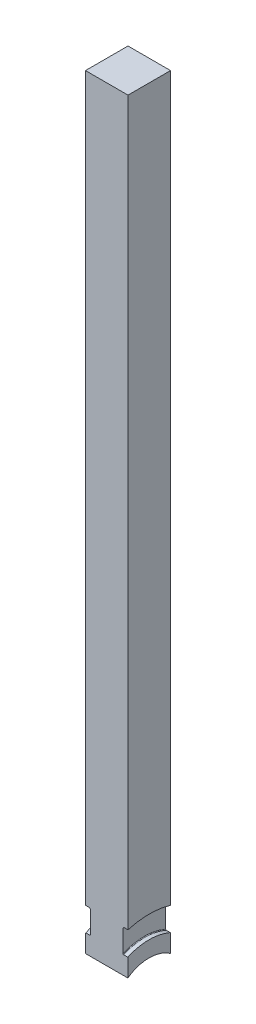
from build123d import *

# Parameters (mm, degrees)
SKETCH1_W               = 25.654
SKETCH1_H               = 479.425
BOSS_EXTRUDE1_DEPTH     = 12.827
CUT_EXTRUDE4_DEPTH      = 480.768063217
CUT_EXTRUDE4_DEPTH_BACK = 480.768063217
SKETCH8_R               = 22.225
SKETCH2_W               = 2.9718
SKETCH2_H               = 13.4874
CUT_EXTRUDE3_DEPTH      = 480.768063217
CUT_EXTRUDE3_DEPTH_BACK = 480.768063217
SKETCH7_W               = 0.127
SKETCH7_H               = 31.75
FILLET1_R               = 0.762
FILLET2_R               = 0.381


with BuildPart() as part:
    # Sketch1 → Boss-Extrude1 (new, symmetric)
    with BuildSketch(Plane(origin=(0, 0, 0), x_dir=(0, 0, -1), z_dir=(1, 0, 0))):
        with Locations((0, 239.7125)):
            Rectangle(SKETCH1_W, SKETCH1_H)
    extrude(amount=BOSS_EXTRUDE1_DEPTH, both=True)

    # Sketch8 → Cut-Extrude4 (cut, two sides: drawn at the far end of the back side and taken through both)
    with BuildSketch(Plane(origin=(0, 0, 0), x_dir=(0, 0, -1), z_dir=(1, 0, 0)).offset(-CUT_EXTRUDE4_DEPTH_BACK)):
        Circle(SKETCH8_R)
    extrude(amount=CUT_EXTRUDE4_DEPTH + CUT_EXTRUDE4_DEPTH_BACK, mode=Mode.SUBTRACT)

    # Sketch2 → Cut-Revolve1 (revolve, cut)
    with BuildSketch(Plane.XY):
        with Locations((11.3411, 38.4937)):
            Rectangle(SKETCH2_W, SKETCH2_H)
        with Locations((-11.3411, 38.4937)):
            Rectangle(SKETCH2_W, SKETCH2_H)
    revolve(axis=Axis((-8.84822894, 0, 0), (1, 0, 0)), mode=Mode.SUBTRACT)

    # Sketch7 → Cut-Extrude3 (cut, two sides: drawn at the far end of the back side and taken through both)
    with BuildSketch(Plane.XY.offset(-CUT_EXTRUDE3_DEPTH_BACK)):
        with Locations((-12.7635, 15.875)):
            Rectangle(SKETCH7_W, SKETCH7_H)
        with Locations((12.7635, 15.875)):
            Rectangle(SKETCH7_W, SKETCH7_H)
    extrude(amount=CUT_EXTRUDE3_DEPTH + CUT_EXTRUDE3_DEPTH_BACK, mode=Mode.SUBTRACT)

    # Fillet1
    fillet1_edges = [part.edges().sort_by_distance(p)[0] for p in [
        (9.8552, 45.2374, 0),
        (-9.8552, 45.2374, 0),
    ]]
    fillet(fillet1_edges, radius=FILLET1_R)

    # Fillet2
    fillet2_edges = [part.edges().sort_by_distance(p)[0] for p in [
        (9.8552, 31.75, 0),
        (-9.8552, 31.75, 0),
    ]]
    fillet(fillet2_edges, radius=FILLET2_R)


solid = part.part
